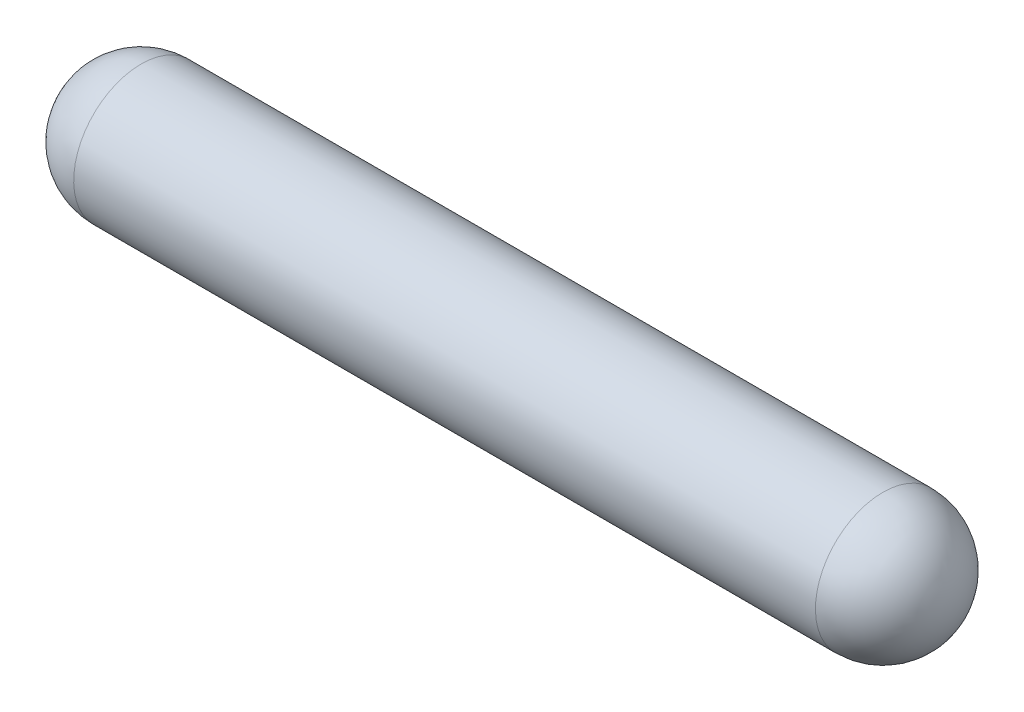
from build123d import *


with BuildPart() as part:
    # Sketch1 → Base-Revolve (revolve)
    with BuildSketch(Plane.XY):
        with BuildLine():
            Line((-34.925, 3.175), (0, 3.175))
            ThreePointArc((0, 3.175), (2.24506403, 2.24506403), (3.175, 0))
            Line((3.175, 0), (-38.1, 0))
            ThreePointArc((-38.1, 0), (-37.17006403, 2.24506403), (-34.925, 3.175))
        make_face()
    revolve(axis=Axis((0, 0, 0), (-1, 0, 0)))


solid = part.part
